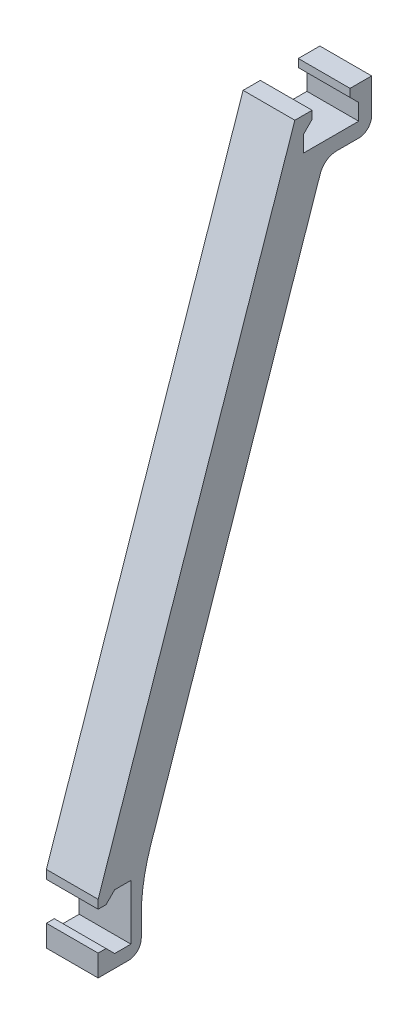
ISO-10303-21;
HEADER;
FILE_DESCRIPTION(('STEP AP214'),'2;1');
FILE_NAME('part.step','',(''),(''),'','','');
FILE_SCHEMA(('AUTOMOTIVE_DESIGN { 1 0 10303 214 1 1 1 1 }'));
ENDSEC;
DATA;
#1=APPLICATION_CONTEXT('core data for automotive mechanical design processes');
#2=APPLICATION_PROTOCOL_DEFINITION('international standard','automotive_design',2000,#1);
#3=PRODUCT_CONTEXT('',#1,'mechanical');
#4=PRODUCT('Part','Part','',(#3));
#5=PRODUCT_RELATED_PRODUCT_CATEGORY('part','',(#4));
#6=PRODUCT_DEFINITION_FORMATION('','',#4);
#7=PRODUCT_DEFINITION_CONTEXT('part definition',#1,'design');
#8=PRODUCT_DEFINITION('design','',#6,#7);
#9=PRODUCT_DEFINITION_SHAPE('','',#8);
#10=(LENGTH_UNIT() NAMED_UNIT(*) SI_UNIT(.MILLI.,.METRE.));
#11=(NAMED_UNIT(*) PLANE_ANGLE_UNIT() SI_UNIT($,.RADIAN.));
#12=(NAMED_UNIT(*) SI_UNIT($,.STERADIAN.) SOLID_ANGLE_UNIT());
#13=UNCERTAINTY_MEASURE_WITH_UNIT(LENGTH_MEASURE(1.E-05),#10,'distance_accuracy_value','');
#14=(GEOMETRIC_REPRESENTATION_CONTEXT(3) GLOBAL_UNCERTAINTY_ASSIGNED_CONTEXT((#13)) GLOBAL_UNIT_ASSIGNED_CONTEXT((#10,
#11,#12)) REPRESENTATION_CONTEXT('',''));
#15=CARTESIAN_POINT('',(0.,0.,0.));
#16=DIRECTION('',(0.,0.,1.));
#17=DIRECTION('',(1.,0.,0.));
#18=AXIS2_PLACEMENT_3D('',#15,#16,#17);
#19=CARTESIAN_POINT('',(6.,-82.2,-10.));
#20=DIRECTION('',(0.,0.,-1.));
#21=DIRECTION('',(-1.,0.,0.));
#22=AXIS2_PLACEMENT_3D('',#19,#20,#21);
#23=PLANE('',#22);
#24=DIRECTION('',(0.,-1.,0.));
#25=VECTOR('',#24,1.);
#26=CARTESIAN_POINT('',(0.,-82.2,-10.));
#27=LINE('',#26,#25);
#28=CARTESIAN_POINT('',(0.,-82.2,-10.));
#29=VERTEX_POINT('',#28);
#30=CARTESIAN_POINT('',(0.,-84.7,-10.));
#31=VERTEX_POINT('',#30);
#32=EDGE_CURVE('E248',#29,#31,#27,.T.);
#33=ORIENTED_EDGE('',*,*,#32,.T.);
#34=DIRECTION('',(-1.,0.,0.));
#35=VECTOR('',#34,1.);
#36=CARTESIAN_POINT('',(6.,-84.7,-10.));
#37=LINE('',#36,#35);
#38=CARTESIAN_POINT('',(6.,-84.7,-10.));
#39=VERTEX_POINT('',#38);
#40=EDGE_CURVE('E229',#39,#31,#37,.T.);
#41=ORIENTED_EDGE('',*,*,#40,.F.);
#42=DIRECTION('',(0.,-1.,0.));
#43=VECTOR('',#42,1.);
#44=CARTESIAN_POINT('',(6.,-82.2,-10.));
#45=LINE('',#44,#43);
#46=CARTESIAN_POINT('',(6.,-82.2,-10.));
#47=VERTEX_POINT('',#46);
#48=EDGE_CURVE('E236',#47,#39,#45,.T.);
#49=ORIENTED_EDGE('',*,*,#48,.F.);
#50=DIRECTION('',(-1.,0.,0.));
#51=VECTOR('',#50,1.);
#52=CARTESIAN_POINT('',(6.,-82.2,-10.));
#53=LINE('',#52,#51);
#54=EDGE_CURVE('E341',#47,#29,#53,.T.);
#55=ORIENTED_EDGE('',*,*,#54,.T.);
#56=EDGE_LOOP('',(#33,#41,#49,#55));
#57=FACE_BOUND('',#56,.T.);
#58=ADVANCED_FACE('F39',(#57),#23,.F.);
#59=CARTESIAN_POINT('',(6.,-84.7,-10.));
#60=DIRECTION('',(0.,1.,0.));
#61=DIRECTION('',(0.,0.,1.));
#62=AXIS2_PLACEMENT_3D('',#59,#60,#61);
#63=PLANE('',#62);
#64=DIRECTION('',(0.,0.,-1.));
#65=VECTOR('',#64,1.);
#66=CARTESIAN_POINT('',(0.,-84.7,-10.));
#67=LINE('',#66,#65);
#68=CARTESIAN_POINT('',(0.,-84.7,-13.5));
#69=VERTEX_POINT('',#68);
#70=EDGE_CURVE('E447',#31,#69,#67,.T.);
#71=ORIENTED_EDGE('',*,*,#70,.T.);
#72=DIRECTION('',(-1.,0.,0.));
#73=VECTOR('',#72,1.);
#74=CARTESIAN_POINT('',(6.,-84.7,-13.5));
#75=LINE('',#74,#73);
#76=CARTESIAN_POINT('',(6.,-84.7,-13.5));
#77=VERTEX_POINT('',#76);
#78=EDGE_CURVE('E232',#69,#77,#75,.F.);
#79=ORIENTED_EDGE('',*,*,#78,.T.);
#80=DIRECTION('',(0.,0.,-1.));
#81=VECTOR('',#80,1.);
#82=CARTESIAN_POINT('',(6.,-84.7,-10.));
#83=LINE('',#82,#81);
#84=EDGE_CURVE('E224',#39,#77,#83,.T.);
#85=ORIENTED_EDGE('',*,*,#84,.F.);
#86=ORIENTED_EDGE('',*,*,#40,.T.);
#87=EDGE_LOOP('',(#71,#79,#85,#86));
#88=FACE_BOUND('',#87,.T.);
#89=ADVANCED_FACE('F227',(#88),#63,.F.);
#90=CARTESIAN_POINT('',(6.,-84.7,-15.));
#91=DIRECTION('',(0.,0.,1.));
#92=DIRECTION('',(1.,0.,0.));
#93=AXIS2_PLACEMENT_3D('',#90,#91,#92);
#94=PLANE('',#93);
#95=DIRECTION('',(0.,1.,0.));
#96=VECTOR('',#95,1.);
#97=CARTESIAN_POINT('',(0.,-84.7,-15.));
#98=LINE('',#97,#96);
#99=CARTESIAN_POINT('',(0.,-83.2,-15.));
#100=VERTEX_POINT('',#99);
#101=CARTESIAN_POINT('',(0.,-80.9489592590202,-15.));
#102=VERTEX_POINT('',#101);
#103=EDGE_CURVE('E303',#100,#102,#98,.T.);
#104=ORIENTED_EDGE('',*,*,#103,.T.);
#105=DIRECTION('',(-1.,0.,0.));
#106=VECTOR('',#105,1.);
#107=CARTESIAN_POINT('',(6.,-80.9489592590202,-15.));
#108=LINE('',#107,#106);
#109=CARTESIAN_POINT('',(6.,-80.9489592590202,-15.));
#110=VERTEX_POINT('',#109);
#111=EDGE_CURVE('E278',#102,#110,#108,.F.);
#112=ORIENTED_EDGE('',*,*,#111,.T.);
#113=DIRECTION('',(0.,1.,0.));
#114=VECTOR('',#113,1.);
#115=CARTESIAN_POINT('',(6.,-84.7,-15.));
#116=LINE('',#115,#114);
#117=CARTESIAN_POINT('',(6.,-83.2,-15.));
#118=VERTEX_POINT('',#117);
#119=EDGE_CURVE('E235',#118,#110,#116,.T.);
#120=ORIENTED_EDGE('',*,*,#119,.F.);
#121=DIRECTION('',(-1.,0.,0.));
#122=VECTOR('',#121,1.);
#123=CARTESIAN_POINT('',(6.,-83.2,-15.));
#124=LINE('',#123,#122);
#125=EDGE_CURVE('E271',#118,#100,#124,.T.);
#126=ORIENTED_EDGE('',*,*,#125,.T.);
#127=EDGE_LOOP('',(#104,#112,#120,#126));
#128=FACE_BOUND('',#127,.T.);
#129=ADVANCED_FACE('F452',(#128),#94,.F.);
#130=CARTESIAN_POINT('',(6.,-77.629791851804,-15.));
#131=DIRECTION('',(0.,0.323020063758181,0.946392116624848));
#132=DIRECTION('',(0.,-0.946392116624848,0.323020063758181));
#133=AXIS2_PLACEMENT_3D('',#130,#131,#132);
#134=PLANE('',#133);
#135=DIRECTION('',(0.,0.946392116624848,-0.323020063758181));
#136=VECTOR('',#135,1.);
#137=CARTESIAN_POINT('',(0.,-77.629791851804,-15.));
#138=LINE('',#137,#136);
#139=CARTESIAN_POINT('',(0.,-74.4885579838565,-16.0721576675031));
#140=VERTEX_POINT('',#139);
#141=CARTESIAN_POINT('',(0.,-16.8539598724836,-35.7438468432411));
#142=VERTEX_POINT('',#141);
#143=EDGE_CURVE('E299',#140,#142,#138,.T.);
#144=ORIENTED_EDGE('',*,*,#143,.T.);
#145=DIRECTION('',(-1.,0.,0.));
#146=VECTOR('',#145,1.);
#147=CARTESIAN_POINT('',(6.,-16.8539598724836,-35.7438468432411));
#148=LINE('',#147,#146);
#149=CARTESIAN_POINT('',(6.,-16.8539598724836,-35.7438468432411));
#150=VERTEX_POINT('',#149);
#151=EDGE_CURVE('E60',#142,#150,#148,.F.);
#152=ORIENTED_EDGE('',*,*,#151,.T.);
#153=DIRECTION('',(0.,0.946392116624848,-0.323020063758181));
#154=VECTOR('',#153,1.);
#155=CARTESIAN_POINT('',(6.,-77.629791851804,-15.));
#156=LINE('',#155,#154);
#157=CARTESIAN_POINT('',(6.,-74.4885579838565,-16.0721576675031));
#158=VERTEX_POINT('',#157);
#159=EDGE_CURVE('E460',#158,#150,#156,.T.);
#160=ORIENTED_EDGE('',*,*,#159,.F.);
#161=DIRECTION('',(-1.,0.,0.));
#162=VECTOR('',#161,1.);
#163=CARTESIAN_POINT('',(0.,-74.4885579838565,-16.0721576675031));
#164=LINE('',#163,#162);
#165=EDGE_CURVE('E275',#158,#140,#164,.T.);
#166=ORIENTED_EDGE('',*,*,#165,.T.);
#167=EDGE_LOOP('',(#144,#152,#160,#166));
#168=FACE_BOUND('',#167,.T.);
#169=ADVANCED_FACE('F461',(#168),#134,.F.);
#170=CARTESIAN_POINT('',(6.,-15.5,-36.2059768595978));
#171=DIRECTION('',(0.,1.,0.));
#172=DIRECTION('',(0.,0.,1.));
#173=AXIS2_PLACEMENT_3D('',#170,#171,#172);
#174=PLANE('',#173);
#175=DIRECTION('',(0.,0.,-1.));
#176=VECTOR('',#175,1.);
#177=CARTESIAN_POINT('',(6.,-15.5,-36.2059768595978));
#178=LINE('',#177,#176);
#179=CARTESIAN_POINT('',(6.,-15.5,-37.6366310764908));
#180=VERTEX_POINT('',#179);
#181=CARTESIAN_POINT('',(6.,-15.5,-40.2));
#182=VERTEX_POINT('',#181);
#183=EDGE_CURVE('E292',#180,#182,#178,.T.);
#184=ORIENTED_EDGE('',*,*,#183,.F.);
#185=DIRECTION('',(-1.,0.,0.));
#186=VECTOR('',#185,1.);
#187=CARTESIAN_POINT('',(0.,-15.5,-37.6366310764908));
#188=LINE('',#187,#186);
#189=CARTESIAN_POINT('',(0.,-15.5,-37.6366310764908));
#190=VERTEX_POINT('',#189);
#191=EDGE_CURVE('E284',#180,#190,#188,.T.);
#192=ORIENTED_EDGE('',*,*,#191,.T.);
#193=DIRECTION('',(0.,0.,-1.));
#194=VECTOR('',#193,1.);
#195=CARTESIAN_POINT('',(0.,-15.5,-36.2059768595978));
#196=LINE('',#195,#194);
#197=CARTESIAN_POINT('',(0.,-15.5,-40.2));
#198=VERTEX_POINT('',#197);
#199=EDGE_CURVE('E291',#190,#198,#196,.T.);
#200=ORIENTED_EDGE('',*,*,#199,.T.);
#201=DIRECTION('',(-1.,0.,0.));
#202=VECTOR('',#201,1.);
#203=CARTESIAN_POINT('',(6.,-15.5,-40.2));
#204=LINE('',#203,#202);
#205=EDGE_CURVE('E264',#198,#182,#204,.F.);
#206=ORIENTED_EDGE('',*,*,#205,.T.);
#207=EDGE_LOOP('',(#184,#192,#200,#206));
#208=FACE_BOUND('',#207,.T.);
#209=ADVANCED_FACE('F290',(#208),#174,.F.);
#210=CARTESIAN_POINT('',(6.,-15.5,-41.7));
#211=DIRECTION('',(0.,0.,1.));
#212=DIRECTION('',(1.,0.,0.));
#213=AXIS2_PLACEMENT_3D('',#210,#211,#212);
#214=PLANE('',#213);
#215=DIRECTION('',(0.,1.,0.));
#216=VECTOR('',#215,1.);
#217=CARTESIAN_POINT('',(6.,-15.5,-41.7));
#218=LINE('',#217,#216);
#219=CARTESIAN_POINT('',(6.,-14.,-41.7));
#220=VERTEX_POINT('',#219);
#221=CARTESIAN_POINT('',(6.,-9.99999999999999,-41.7));
#222=VERTEX_POINT('',#221);
#223=EDGE_CURVE('E463',#220,#222,#218,.T.);
#224=ORIENTED_EDGE('',*,*,#223,.F.);
#225=DIRECTION('',(-1.,0.,0.));
#226=VECTOR('',#225,1.);
#227=CARTESIAN_POINT('',(6.,-14.,-41.7));
#228=LINE('',#227,#226);
#229=CARTESIAN_POINT('',(0.,-14.,-41.7));
#230=VERTEX_POINT('',#229);
#231=EDGE_CURVE('E249',#220,#230,#228,.T.);
#232=ORIENTED_EDGE('',*,*,#231,.T.);
#233=DIRECTION('',(0.,1.,0.));
#234=VECTOR('',#233,1.);
#235=CARTESIAN_POINT('',(0.,-15.5,-41.7));
#236=LINE('',#235,#234);
#237=CARTESIAN_POINT('',(0.,-9.99999999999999,-41.7));
#238=VERTEX_POINT('',#237);
#239=EDGE_CURVE('E298',#230,#238,#236,.T.);
#240=ORIENTED_EDGE('',*,*,#239,.T.);
#241=DIRECTION('',(-1.,0.,0.));
#242=VECTOR('',#241,1.);
#243=CARTESIAN_POINT('',(6.,-9.99999999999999,-41.7));
#244=LINE('',#243,#242);
#245=EDGE_CURVE('E250',#222,#238,#244,.T.);
#246=ORIENTED_EDGE('',*,*,#245,.F.);
#247=EDGE_LOOP('',(#224,#232,#240,#246));
#248=FACE_BOUND('',#247,.T.);
#249=ADVANCED_FACE('F473',(#248),#214,.F.);
#250=CARTESIAN_POINT('',(6.,-9.99999999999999,-41.7));
#251=DIRECTION('',(0.,-1.,0.));
#252=DIRECTION('',(0.,0.,-1.));
#253=AXIS2_PLACEMENT_3D('',#250,#251,#252);
#254=PLANE('',#253);
#255=DIRECTION('',(0.,0.,1.));
#256=VECTOR('',#255,1.);
#257=CARTESIAN_POINT('',(0.,-9.99999999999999,-41.7));
#258=LINE('',#257,#256);
#259=CARTESIAN_POINT('',(0.,-9.99999999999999,-39.2));
#260=VERTEX_POINT('',#259);
#261=EDGE_CURVE('E301',#238,#260,#258,.T.);
#262=ORIENTED_EDGE('',*,*,#261,.T.);
#263=DIRECTION('',(-1.,0.,0.));
#264=VECTOR('',#263,1.);
#265=CARTESIAN_POINT('',(6.,-9.99999999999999,-39.2));
#266=LINE('',#265,#264);
#267=CARTESIAN_POINT('',(6.,-9.99999999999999,-39.2));
#268=VERTEX_POINT('',#267);
#269=EDGE_CURVE('E256',#268,#260,#266,.T.);
#270=ORIENTED_EDGE('',*,*,#269,.F.);
#271=DIRECTION('',(0.,0.,1.));
#272=VECTOR('',#271,1.);
#273=CARTESIAN_POINT('',(6.,-9.99999999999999,-41.7));
#274=LINE('',#273,#272);
#275=EDGE_CURVE('E468',#222,#268,#274,.T.);
#276=ORIENTED_EDGE('',*,*,#275,.F.);
#277=ORIENTED_EDGE('',*,*,#245,.T.);
#278=EDGE_LOOP('',(#262,#270,#276,#277));
#279=FACE_BOUND('',#278,.T.);
#280=ADVANCED_FACE('F471',(#279),#254,.F.);
#281=CARTESIAN_POINT('',(6.,-9.99999999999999,-39.2));
#282=DIRECTION('',(0.,0.,-1.));
#283=DIRECTION('',(0.,1.,0.));
#284=AXIS2_PLACEMENT_3D('',#281,#282,#283);
#285=PLANE('',#284);
#286=DIRECTION('',(0.,-1.,0.));
#287=VECTOR('',#286,1.);
#288=CARTESIAN_POINT('',(0.,-9.99999999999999,-39.2));
#289=LINE('',#288,#287);
#290=CARTESIAN_POINT('',(0.,-10.9171572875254,-39.2));
#291=VERTEX_POINT('',#290);
#292=EDGE_CURVE('E308',#260,#291,#289,.T.);
#293=ORIENTED_EDGE('',*,*,#292,.T.);
#294=DIRECTION('',(-1.,0.,0.));
#295=VECTOR('',#294,1.);
#296=CARTESIAN_POINT('',(6.,-10.9171572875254,-39.2));
#297=LINE('',#296,#295);
#298=CARTESIAN_POINT('',(6.,-10.9171572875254,-39.2));
#299=VERTEX_POINT('',#298);
#300=EDGE_CURVE('E388',#299,#291,#297,.T.);
#301=ORIENTED_EDGE('',*,*,#300,.F.);
#302=DIRECTION('',(0.,-1.,0.));
#303=VECTOR('',#302,1.);
#304=CARTESIAN_POINT('',(6.,-9.99999999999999,-39.2));
#305=LINE('',#304,#303);
#306=EDGE_CURVE('E397',#268,#299,#305,.T.);
#307=ORIENTED_EDGE('',*,*,#306,.F.);
#308=ORIENTED_EDGE('',*,*,#269,.T.);
#309=EDGE_LOOP('',(#293,#301,#307,#308));
#310=FACE_BOUND('',#309,.T.);
#311=ADVANCED_FACE('F395',(#310),#285,.F.);
#312=CARTESIAN_POINT('',(6.,-10.9171572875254,-39.2));
#313=DIRECTION('',(0.,0.707106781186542,-0.707106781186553));
#314=DIRECTION('',(0.,0.707106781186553,0.707106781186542));
#315=AXIS2_PLACEMENT_3D('',#312,#313,#314);
#316=PLANE('',#315);
#317=DIRECTION('',(0.,-0.707106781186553,-0.707106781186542));
#318=VECTOR('',#317,1.);
#319=CARTESIAN_POINT('',(0.,-10.9171572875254,-39.2));
#320=LINE('',#319,#318);
#321=CARTESIAN_POINT('',(0.,-11.9171572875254,-40.2));
#322=VERTEX_POINT('',#321);
#323=EDGE_CURVE('E310',#291,#322,#320,.T.);
#324=ORIENTED_EDGE('',*,*,#323,.T.);
#325=DIRECTION('',(-1.,0.,0.));
#326=VECTOR('',#325,1.);
#327=CARTESIAN_POINT('',(6.,-11.9171572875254,-40.2));
#328=LINE('',#327,#326);
#329=CARTESIAN_POINT('',(6.,-11.9171572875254,-40.2));
#330=VERTEX_POINT('',#329);
#331=EDGE_CURVE('E385',#330,#322,#328,.T.);
#332=ORIENTED_EDGE('',*,*,#331,.F.);
#333=DIRECTION('',(0.,-0.707106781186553,-0.707106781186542));
#334=VECTOR('',#333,1.);
#335=CARTESIAN_POINT('',(6.,-10.9171572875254,-39.2));
#336=LINE('',#335,#334);
#337=EDGE_CURVE('E415',#299,#330,#336,.T.);
#338=ORIENTED_EDGE('',*,*,#337,.F.);
#339=ORIENTED_EDGE('',*,*,#300,.T.);
#340=EDGE_LOOP('',(#324,#332,#338,#339));
#341=FACE_BOUND('',#340,.T.);
#342=ADVANCED_FACE('F406',(#341),#316,.F.);
#343=CARTESIAN_POINT('',(6.,-11.9171572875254,-40.2));
#344=DIRECTION('',(0.,0.,-1.));
#345=DIRECTION('',(-1.,0.,0.));
#346=AXIS2_PLACEMENT_3D('',#343,#344,#345);
#347=PLANE('',#346);
#348=DIRECTION('',(0.,-1.,0.));
#349=VECTOR('',#348,1.);
#350=CARTESIAN_POINT('',(0.,-11.9171572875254,-40.2));
#351=LINE('',#350,#349);
#352=CARTESIAN_POINT('',(0.,-13.8,-40.2));
#353=VERTEX_POINT('',#352);
#354=EDGE_CURVE('E312',#322,#353,#351,.T.);
#355=ORIENTED_EDGE('',*,*,#354,.T.);
#356=DIRECTION('',(-1.,0.,0.));
#357=VECTOR('',#356,1.);
#358=CARTESIAN_POINT('',(6.,-13.8,-40.2));
#359=LINE('',#358,#357);
#360=CARTESIAN_POINT('',(6.,-13.8,-40.2));
#361=VERTEX_POINT('',#360);
#362=EDGE_CURVE('E382',#361,#353,#359,.T.);
#363=ORIENTED_EDGE('',*,*,#362,.F.);
#364=DIRECTION('',(0.,-1.,0.));
#365=VECTOR('',#364,1.);
#366=CARTESIAN_POINT('',(6.,-11.9171572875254,-40.2));
#367=LINE('',#366,#365);
#368=EDGE_CURVE('E412',#330,#361,#367,.T.);
#369=ORIENTED_EDGE('',*,*,#368,.F.);
#370=ORIENTED_EDGE('',*,*,#331,.T.);
#371=EDGE_LOOP('',(#355,#363,#369,#370));
#372=FACE_BOUND('',#371,.T.);
#373=ADVANCED_FACE('F410',(#372),#347,.F.);
#374=CARTESIAN_POINT('',(6.,-13.8,-40.2));
#375=DIRECTION('',(0.,-1.,0.));
#376=DIRECTION('',(0.,0.,-1.));
#377=AXIS2_PLACEMENT_3D('',#374,#375,#376);
#378=PLANE('',#377);
#379=DIRECTION('',(0.,0.,1.));
#380=VECTOR('',#379,1.);
#381=CARTESIAN_POINT('',(0.,-13.8,-40.2));
#382=LINE('',#381,#380);
#383=CARTESIAN_POINT('',(0.,-13.8,-33.8));
#384=VERTEX_POINT('',#383);
#385=EDGE_CURVE('E314',#353,#384,#382,.T.);
#386=ORIENTED_EDGE('',*,*,#385,.T.);
#387=DIRECTION('',(-1.,0.,0.));
#388=VECTOR('',#387,1.);
#389=CARTESIAN_POINT('',(6.,-13.8,-33.8));
#390=LINE('',#389,#388);
#391=CARTESIAN_POINT('',(6.,-13.8,-33.8));
#392=VERTEX_POINT('',#391);
#393=EDGE_CURVE('E379',#392,#384,#390,.T.);
#394=ORIENTED_EDGE('',*,*,#393,.F.);
#395=DIRECTION('',(0.,0.,1.));
#396=VECTOR('',#395,1.);
#397=CARTESIAN_POINT('',(6.,-13.8,-40.2));
#398=LINE('',#397,#396);
#399=EDGE_CURVE('E414',#361,#392,#398,.T.);
#400=ORIENTED_EDGE('',*,*,#399,.F.);
#401=ORIENTED_EDGE('',*,*,#362,.T.);
#402=EDGE_LOOP('',(#386,#394,#400,#401));
#403=FACE_BOUND('',#402,.T.);
#404=ADVANCED_FACE('F565',(#403),#378,.F.);
#405=CARTESIAN_POINT('',(6.,-13.8,-33.8));
#406=DIRECTION('',(0.,0.,1.));
#407=DIRECTION('',(1.,0.,0.));
#408=AXIS2_PLACEMENT_3D('',#405,#406,#407);
#409=PLANE('',#408);
#410=DIRECTION('',(0.,1.,0.));
#411=VECTOR('',#410,1.);
#412=CARTESIAN_POINT('',(0.,-13.8,-33.8));
#413=LINE('',#412,#411);
#414=CARTESIAN_POINT('',(0.,-11.9171572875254,-33.8));
#415=VERTEX_POINT('',#414);
#416=EDGE_CURVE('E316',#384,#415,#413,.T.);
#417=ORIENTED_EDGE('',*,*,#416,.T.);
#418=DIRECTION('',(-1.,0.,0.));
#419=VECTOR('',#418,1.);
#420=CARTESIAN_POINT('',(6.,-11.9171572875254,-33.8));
#421=LINE('',#420,#419);
#422=CARTESIAN_POINT('',(6.,-11.9171572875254,-33.8));
#423=VERTEX_POINT('',#422);
#424=EDGE_CURVE('E376',#423,#415,#421,.T.);
#425=ORIENTED_EDGE('',*,*,#424,.F.);
#426=DIRECTION('',(0.,1.,0.));
#427=VECTOR('',#426,1.);
#428=CARTESIAN_POINT('',(6.,-13.8,-33.8));
#429=LINE('',#428,#427);
#430=EDGE_CURVE('E417',#392,#423,#429,.T.);
#431=ORIENTED_EDGE('',*,*,#430,.F.);
#432=ORIENTED_EDGE('',*,*,#393,.T.);
#433=EDGE_LOOP('',(#417,#425,#431,#432));
#434=FACE_BOUND('',#433,.T.);
#435=ADVANCED_FACE('F561',(#434),#409,.F.);
#436=CARTESIAN_POINT('',(6.,-11.9171572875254,-33.8));
#437=DIRECTION('',(0.,0.707106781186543,0.707106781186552));
#438=DIRECTION('',(0.,-0.707106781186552,0.707106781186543));
#439=AXIS2_PLACEMENT_3D('',#436,#437,#438);
#440=PLANE('',#439);
#441=DIRECTION('',(0.,0.707106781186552,-0.707106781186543));
#442=VECTOR('',#441,1.);
#443=CARTESIAN_POINT('',(0.,-11.9171572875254,-33.8));
#444=LINE('',#443,#442);
#445=CARTESIAN_POINT('',(0.,-10.9171572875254,-34.8));
#446=VERTEX_POINT('',#445);
#447=EDGE_CURVE('E318',#415,#446,#444,.T.);
#448=ORIENTED_EDGE('',*,*,#447,.T.);
#449=DIRECTION('',(-1.,0.,0.));
#450=VECTOR('',#449,1.);
#451=CARTESIAN_POINT('',(6.,-10.9171572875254,-34.8));
#452=LINE('',#451,#450);
#453=CARTESIAN_POINT('',(6.,-10.9171572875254,-34.8));
#454=VERTEX_POINT('',#453);
#455=EDGE_CURVE('E373',#454,#446,#452,.T.);
#456=ORIENTED_EDGE('',*,*,#455,.F.);
#457=DIRECTION('',(0.,0.707106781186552,-0.707106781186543));
#458=VECTOR('',#457,1.);
#459=CARTESIAN_POINT('',(6.,-11.9171572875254,-33.8));
#460=LINE('',#459,#458);
#461=EDGE_CURVE('E423',#423,#454,#460,.T.);
#462=ORIENTED_EDGE('',*,*,#461,.F.);
#463=ORIENTED_EDGE('',*,*,#424,.T.);
#464=EDGE_LOOP('',(#448,#456,#462,#463));
#465=FACE_BOUND('',#464,.T.);
#466=ADVANCED_FACE('F557',(#465),#440,.F.);
#467=CARTESIAN_POINT('',(6.,-10.9171572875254,-34.8));
#468=DIRECTION('',(0.,0.,1.));
#469=DIRECTION('',(0.,-1.,0.));
#470=AXIS2_PLACEMENT_3D('',#467,#468,#469);
#471=PLANE('',#470);
#472=DIRECTION('',(0.,1.,0.));
#473=VECTOR('',#472,1.);
#474=CARTESIAN_POINT('',(0.,-10.9171572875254,-34.8));
#475=LINE('',#474,#473);
#476=CARTESIAN_POINT('',(0.,-9.99999999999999,-34.8));
#477=VERTEX_POINT('',#476);
#478=EDGE_CURVE('E320',#446,#477,#475,.T.);
#479=ORIENTED_EDGE('',*,*,#478,.T.);
#480=DIRECTION('',(-1.,0.,0.));
#481=VECTOR('',#480,1.);
#482=CARTESIAN_POINT('',(6.,-9.99999999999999,-34.8));
#483=LINE('',#482,#481);
#484=CARTESIAN_POINT('',(6.,-9.99999999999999,-34.8));
#485=VERTEX_POINT('',#484);
#486=EDGE_CURVE('E370',#485,#477,#483,.T.);
#487=ORIENTED_EDGE('',*,*,#486,.F.);
#488=DIRECTION('',(0.,1.,0.));
#489=VECTOR('',#488,1.);
#490=CARTESIAN_POINT('',(6.,-10.9171572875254,-34.8));
#491=LINE('',#490,#489);
#492=EDGE_CURVE('E425',#454,#485,#491,.T.);
#493=ORIENTED_EDGE('',*,*,#492,.F.);
#494=ORIENTED_EDGE('',*,*,#455,.T.);
#495=EDGE_LOOP('',(#479,#487,#493,#494));
#496=FACE_BOUND('',#495,.T.);
#497=ADVANCED_FACE('F553',(#496),#471,.F.);
#498=CARTESIAN_POINT('',(6.,-9.99999999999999,-34.8));
#499=DIRECTION('',(0.,-1.,0.));
#500=DIRECTION('',(0.,0.,-1.));
#501=AXIS2_PLACEMENT_3D('',#498,#499,#500);
#502=PLANE('',#501);
#503=DIRECTION('',(0.,0.,1.));
#504=VECTOR('',#503,1.);
#505=CARTESIAN_POINT('',(0.,-9.99999999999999,-34.8));
#506=LINE('',#505,#504);
#507=CARTESIAN_POINT('',(0.,-9.99999999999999,-32.8));
#508=VERTEX_POINT('',#507);
#509=EDGE_CURVE('E322',#477,#508,#506,.T.);
#510=ORIENTED_EDGE('',*,*,#509,.T.);
#511=DIRECTION('',(-1.,0.,0.));
#512=VECTOR('',#511,1.);
#513=CARTESIAN_POINT('',(6.,-9.99999999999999,-32.8));
#514=LINE('',#513,#512);
#515=CARTESIAN_POINT('',(6.,-9.99999999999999,-32.8));
#516=VERTEX_POINT('',#515);
#517=EDGE_CURVE('E367',#516,#508,#514,.T.);
#518=ORIENTED_EDGE('',*,*,#517,.F.);
#519=DIRECTION('',(0.,0.,1.));
#520=VECTOR('',#519,1.);
#521=CARTESIAN_POINT('',(6.,-9.99999999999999,-34.8));
#522=LINE('',#521,#520);
#523=EDGE_CURVE('E427',#485,#516,#522,.T.);
#524=ORIENTED_EDGE('',*,*,#523,.F.);
#525=ORIENTED_EDGE('',*,*,#486,.T.);
#526=EDGE_LOOP('',(#510,#518,#524,#525));
#527=FACE_BOUND('',#526,.T.);
#528=ADVANCED_FACE('F548',(#527),#502,.F.);
#529=CARTESIAN_POINT('',(6.,-9.99999999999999,-32.8));
#530=DIRECTION('',(0.,-0.323020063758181,-0.946392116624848));
#531=DIRECTION('',(0.,0.946392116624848,-0.323020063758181));
#532=AXIS2_PLACEMENT_3D('',#529,#530,#531);
#533=PLANE('',#532);
#534=DIRECTION('',(0.,-0.946392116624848,0.323020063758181));
#535=VECTOR('',#534,1.);
#536=CARTESIAN_POINT('',(0.,-9.99999999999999,-32.8));
#537=LINE('',#536,#535);
#538=CARTESIAN_POINT('',(0.,-76.8,-10.));
#539=VERTEX_POINT('',#538);
#540=EDGE_CURVE('E324',#508,#539,#537,.T.);
#541=ORIENTED_EDGE('',*,*,#540,.T.);
#542=DIRECTION('',(-1.,0.,0.));
#543=VECTOR('',#542,1.);
#544=CARTESIAN_POINT('',(6.,-76.8,-10.));
#545=LINE('',#544,#543);
#546=CARTESIAN_POINT('',(6.,-76.8,-10.));
#547=VERTEX_POINT('',#546);
#548=EDGE_CURVE('E364',#547,#539,#545,.T.);
#549=ORIENTED_EDGE('',*,*,#548,.F.);
#550=DIRECTION('',(0.,-0.946392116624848,0.323020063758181));
#551=VECTOR('',#550,1.);
#552=CARTESIAN_POINT('',(6.,-9.99999999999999,-32.8));
#553=LINE('',#552,#551);
#554=EDGE_CURVE('E429',#516,#547,#553,.T.);
#555=ORIENTED_EDGE('',*,*,#554,.F.);
#556=ORIENTED_EDGE('',*,*,#517,.T.);
#557=EDGE_LOOP('',(#541,#549,#555,#556));
#558=FACE_BOUND('',#557,.T.);
#559=ADVANCED_FACE('F542',(#558),#533,.F.);
#560=CARTESIAN_POINT('',(6.,-76.8,-10.));
#561=DIRECTION('',(0.,0.,-1.));
#562=DIRECTION('',(-1.,0.,0.));
#563=AXIS2_PLACEMENT_3D('',#560,#561,#562);
#564=PLANE('',#563);
#565=DIRECTION('',(0.,-1.,0.));
#566=VECTOR('',#565,1.);
#567=CARTESIAN_POINT('',(0.,-76.8,-10.));
#568=LINE('',#567,#566);
#569=CARTESIAN_POINT('',(0.,-77.8,-10.));
#570=VERTEX_POINT('',#569);
#571=EDGE_CURVE('E326',#539,#570,#568,.T.);
#572=ORIENTED_EDGE('',*,*,#571,.T.);
#573=DIRECTION('',(-1.,0.,0.));
#574=VECTOR('',#573,1.);
#575=CARTESIAN_POINT('',(6.,-77.8,-10.));
#576=LINE('',#575,#574);
#577=CARTESIAN_POINT('',(6.,-77.8,-10.));
#578=VERTEX_POINT('',#577);
#579=EDGE_CURVE('E361',#578,#570,#576,.T.);
#580=ORIENTED_EDGE('',*,*,#579,.F.);
#581=DIRECTION('',(0.,-1.,0.));
#582=VECTOR('',#581,1.);
#583=CARTESIAN_POINT('',(6.,-76.8,-10.));
#584=LINE('',#583,#582);
#585=EDGE_CURVE('E431',#547,#578,#584,.T.);
#586=ORIENTED_EDGE('',*,*,#585,.F.);
#587=ORIENTED_EDGE('',*,*,#548,.T.);
#588=EDGE_LOOP('',(#572,#580,#586,#587));
#589=FACE_BOUND('',#588,.T.);
#590=ADVANCED_FACE('F538',(#589),#564,.F.);
#591=CARTESIAN_POINT('',(6.,-77.8,-10.));
#592=DIRECTION('',(0.,1.,0.));
#593=DIRECTION('',(0.,0.,1.));
#594=AXIS2_PLACEMENT_3D('',#591,#592,#593);
#595=PLANE('',#594);
#596=DIRECTION('',(0.,0.,-1.));
#597=VECTOR('',#596,1.);
#598=CARTESIAN_POINT('',(0.,-77.8,-10.));
#599=LINE('',#598,#597);
#600=CARTESIAN_POINT('',(0.,-77.8,-10.9171572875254));
#601=VERTEX_POINT('',#600);
#602=EDGE_CURVE('E328',#570,#601,#599,.T.);
#603=ORIENTED_EDGE('',*,*,#602,.T.);
#604=DIRECTION('',(-1.,0.,0.));
#605=VECTOR('',#604,1.);
#606=CARTESIAN_POINT('',(6.,-77.8,-10.9171572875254));
#607=LINE('',#606,#605);
#608=CARTESIAN_POINT('',(6.,-77.8,-10.9171572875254));
#609=VERTEX_POINT('',#608);
#610=EDGE_CURVE('E358',#609,#601,#607,.T.);
#611=ORIENTED_EDGE('',*,*,#610,.F.);
#612=DIRECTION('',(0.,0.,-1.));
#613=VECTOR('',#612,1.);
#614=CARTESIAN_POINT('',(6.,-77.8,-10.));
#615=LINE('',#614,#613);
#616=EDGE_CURVE('E433',#578,#609,#615,.T.);
#617=ORIENTED_EDGE('',*,*,#616,.F.);
#618=ORIENTED_EDGE('',*,*,#579,.T.);
#619=EDGE_LOOP('',(#603,#611,#617,#618));
#620=FACE_BOUND('',#619,.T.);
#621=ADVANCED_FACE('F533',(#620),#595,.F.);
#622=CARTESIAN_POINT('',(6.,-77.8,-10.9171572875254));
#623=DIRECTION('',(0.,0.707106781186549,0.707106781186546));
#624=DIRECTION('',(0.,-0.707106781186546,0.707106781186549));
#625=AXIS2_PLACEMENT_3D('',#622,#623,#624);
#626=PLANE('',#625);
#627=DIRECTION('',(0.,0.707106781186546,-0.707106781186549));
#628=VECTOR('',#627,1.);
#629=CARTESIAN_POINT('',(0.,-77.8,-10.9171572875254));
#630=LINE('',#629,#628);
#631=CARTESIAN_POINT('',(0.,-76.8,-11.9171572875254));
#632=VERTEX_POINT('',#631);
#633=EDGE_CURVE('E330',#601,#632,#630,.T.);
#634=ORIENTED_EDGE('',*,*,#633,.T.);
#635=DIRECTION('',(-1.,0.,0.));
#636=VECTOR('',#635,1.);
#637=CARTESIAN_POINT('',(6.,-76.8,-11.9171572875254));
#638=LINE('',#637,#636);
#639=CARTESIAN_POINT('',(6.,-76.8,-11.9171572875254));
#640=VERTEX_POINT('',#639);
#641=EDGE_CURVE('E355',#640,#632,#638,.T.);
#642=ORIENTED_EDGE('',*,*,#641,.F.);
#643=DIRECTION('',(0.,0.707106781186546,-0.707106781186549));
#644=VECTOR('',#643,1.);
#645=CARTESIAN_POINT('',(6.,-77.8,-10.9171572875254));
#646=LINE('',#645,#644);
#647=EDGE_CURVE('E435',#609,#640,#646,.T.);
#648=ORIENTED_EDGE('',*,*,#647,.F.);
#649=ORIENTED_EDGE('',*,*,#610,.T.);
#650=EDGE_LOOP('',(#634,#642,#648,#649));
#651=FACE_BOUND('',#650,.T.);
#652=ADVANCED_FACE('F527',(#651),#626,.F.);
#653=CARTESIAN_POINT('',(6.,-76.8,-11.9171572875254));
#654=DIRECTION('',(0.,1.,0.));
#655=DIRECTION('',(0.,0.,1.));
#656=AXIS2_PLACEMENT_3D('',#653,#654,#655);
#657=PLANE('',#656);
#658=DIRECTION('',(0.,0.,-1.));
#659=VECTOR('',#658,1.);
#660=CARTESIAN_POINT('',(0.,-76.8,-11.9171572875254));
#661=LINE('',#660,#659);
#662=CARTESIAN_POINT('',(0.,-76.8,-13.8));
#663=VERTEX_POINT('',#662);
#664=EDGE_CURVE('E332',#632,#663,#661,.T.);
#665=ORIENTED_EDGE('',*,*,#664,.T.);
#666=DIRECTION('',(-1.,0.,0.));
#667=VECTOR('',#666,1.);
#668=CARTESIAN_POINT('',(6.,-76.8,-13.8));
#669=LINE('',#668,#667);
#670=CARTESIAN_POINT('',(6.,-76.8,-13.8));
#671=VERTEX_POINT('',#670);
#672=EDGE_CURVE('E352',#671,#663,#669,.T.);
#673=ORIENTED_EDGE('',*,*,#672,.F.);
#674=DIRECTION('',(0.,0.,-1.));
#675=VECTOR('',#674,1.);
#676=CARTESIAN_POINT('',(6.,-76.8,-11.9171572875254));
#677=LINE('',#676,#675);
#678=EDGE_CURVE('E437',#640,#671,#677,.T.);
#679=ORIENTED_EDGE('',*,*,#678,.F.);
#680=ORIENTED_EDGE('',*,*,#641,.T.);
#681=EDGE_LOOP('',(#665,#673,#679,#680));
#682=FACE_BOUND('',#681,.T.);
#683=ADVANCED_FACE('F523',(#682),#657,.F.);
#684=CARTESIAN_POINT('',(6.,-76.8,-13.8));
#685=DIRECTION('',(0.,0.,-1.));
#686=DIRECTION('',(0.,1.,0.));
#687=AXIS2_PLACEMENT_3D('',#684,#685,#686);
#688=PLANE('',#687);
#689=DIRECTION('',(0.,-1.,0.));
#690=VECTOR('',#689,1.);
#691=CARTESIAN_POINT('',(0.,-76.8,-13.8));
#692=LINE('',#691,#690);
#693=CARTESIAN_POINT('',(0.,-83.2,-13.8));
#694=VERTEX_POINT('',#693);
#695=EDGE_CURVE('E334',#663,#694,#692,.T.);
#696=ORIENTED_EDGE('',*,*,#695,.T.);
#697=DIRECTION('',(-1.,0.,0.));
#698=VECTOR('',#697,1.);
#699=CARTESIAN_POINT('',(6.,-83.2,-13.8));
#700=LINE('',#699,#698);
#701=CARTESIAN_POINT('',(6.,-83.2,-13.8));
#702=VERTEX_POINT('',#701);
#703=EDGE_CURVE('E349',#702,#694,#700,.T.);
#704=ORIENTED_EDGE('',*,*,#703,.F.);
#705=DIRECTION('',(0.,-1.,0.));
#706=VECTOR('',#705,1.);
#707=CARTESIAN_POINT('',(6.,-76.8,-13.8));
#708=LINE('',#707,#706);
#709=EDGE_CURVE('E439',#671,#702,#708,.T.);
#710=ORIENTED_EDGE('',*,*,#709,.F.);
#711=ORIENTED_EDGE('',*,*,#672,.T.);
#712=EDGE_LOOP('',(#696,#704,#710,#711));
#713=FACE_BOUND('',#712,.T.);
#714=ADVANCED_FACE('F518',(#713),#688,.F.);
#715=CARTESIAN_POINT('',(6.,-83.2,-13.8));
#716=DIRECTION('',(0.,-1.,0.));
#717=DIRECTION('',(0.,0.,-1.));
#718=AXIS2_PLACEMENT_3D('',#715,#716,#717);
#719=PLANE('',#718);
#720=DIRECTION('',(0.,0.,1.));
#721=VECTOR('',#720,1.);
#722=CARTESIAN_POINT('',(0.,-83.2,-13.8));
#723=LINE('',#722,#721);
#724=CARTESIAN_POINT('',(0.,-83.2,-11.9171572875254));
#725=VERTEX_POINT('',#724);
#726=EDGE_CURVE('E336',#694,#725,#723,.T.);
#727=ORIENTED_EDGE('',*,*,#726,.T.);
#728=DIRECTION('',(-1.,0.,0.));
#729=VECTOR('',#728,1.);
#730=CARTESIAN_POINT('',(6.,-83.2,-11.9171572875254));
#731=LINE('',#730,#729);
#732=CARTESIAN_POINT('',(6.,-83.2,-11.9171572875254));
#733=VERTEX_POINT('',#732);
#734=EDGE_CURVE('E346',#733,#725,#731,.T.);
#735=ORIENTED_EDGE('',*,*,#734,.F.);
#736=DIRECTION('',(0.,0.,1.));
#737=VECTOR('',#736,1.);
#738=CARTESIAN_POINT('',(6.,-83.2,-13.8));
#739=LINE('',#738,#737);
#740=EDGE_CURVE('E441',#702,#733,#739,.T.);
#741=ORIENTED_EDGE('',*,*,#740,.F.);
#742=ORIENTED_EDGE('',*,*,#703,.T.);
#743=EDGE_LOOP('',(#727,#735,#741,#742));
#744=FACE_BOUND('',#743,.T.);
#745=ADVANCED_FACE('F512',(#744),#719,.F.);
#746=CARTESIAN_POINT('',(6.,-83.2,-11.9171572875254));
#747=DIRECTION('',(0.,-0.707106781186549,0.707106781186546));
#748=DIRECTION('',(0.,-0.707106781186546,-0.707106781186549));
#749=AXIS2_PLACEMENT_3D('',#746,#747,#748);
#750=PLANE('',#749);
#751=DIRECTION('',(0.,0.707106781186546,0.707106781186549));
#752=VECTOR('',#751,1.);
#753=CARTESIAN_POINT('',(0.,-83.2,-11.9171572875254));
#754=LINE('',#753,#752);
#755=CARTESIAN_POINT('',(0.,-82.2,-10.9171572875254));
#756=VERTEX_POINT('',#755);
#757=EDGE_CURVE('E338',#725,#756,#754,.T.);
#758=ORIENTED_EDGE('',*,*,#757,.T.);
#759=DIRECTION('',(-1.,0.,0.));
#760=VECTOR('',#759,1.);
#761=CARTESIAN_POINT('',(6.,-82.2,-10.9171572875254));
#762=LINE('',#761,#760);
#763=CARTESIAN_POINT('',(6.,-82.2,-10.9171572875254));
#764=VERTEX_POINT('',#763);
#765=EDGE_CURVE('E343',#764,#756,#762,.T.);
#766=ORIENTED_EDGE('',*,*,#765,.F.);
#767=DIRECTION('',(0.,0.707106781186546,0.707106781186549));
#768=VECTOR('',#767,1.);
#769=CARTESIAN_POINT('',(6.,-83.2,-11.9171572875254));
#770=LINE('',#769,#768);
#771=EDGE_CURVE('E443',#733,#764,#770,.T.);
#772=ORIENTED_EDGE('',*,*,#771,.F.);
#773=ORIENTED_EDGE('',*,*,#734,.T.);
#774=EDGE_LOOP('',(#758,#766,#772,#773));
#775=FACE_BOUND('',#774,.T.);
#776=ADVANCED_FACE('F508',(#775),#750,.F.);
#777=CARTESIAN_POINT('',(6.,-82.2,-10.9171572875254));
#778=DIRECTION('',(0.,-1.,0.));
#779=DIRECTION('',(0.,0.,-1.));
#780=AXIS2_PLACEMENT_3D('',#777,#778,#779);
#781=PLANE('',#780);
#782=DIRECTION('',(0.,0.,1.));
#783=VECTOR('',#782,1.);
#784=CARTESIAN_POINT('',(0.,-82.2,-10.9171572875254));
#785=LINE('',#784,#783);
#786=EDGE_CURVE('E245',#756,#29,#785,.T.);
#787=ORIENTED_EDGE('',*,*,#786,.T.);
#788=ORIENTED_EDGE('',*,*,#54,.F.);
#789=DIRECTION('',(0.,0.,1.));
#790=VECTOR('',#789,1.);
#791=CARTESIAN_POINT('',(6.,-82.2,-10.9171572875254));
#792=LINE('',#791,#790);
#793=EDGE_CURVE('E241',#764,#47,#792,.T.);
#794=ORIENTED_EDGE('',*,*,#793,.F.);
#795=ORIENTED_EDGE('',*,*,#765,.T.);
#796=EDGE_LOOP('',(#787,#788,#794,#795));
#797=FACE_BOUND('',#796,.T.);
#798=ADVANCED_FACE('F504',(#797),#781,.F.);
#799=CARTESIAN_POINT('',(6.,0.,0.));
#800=DIRECTION('',(1.,0.,0.));
#801=DIRECTION('',(0.,0.,-1.));
#802=AXIS2_PLACEMENT_3D('',#799,#800,#801);
#803=PLANE('',#802);
#804=ORIENTED_EDGE('',*,*,#159,.T.);
#805=CARTESIAN_POINT('',(6.,-17.5,-37.6366310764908));
#806=DIRECTION('',(1.,0.,0.));
#807=DIRECTION('',(0.,0.,-1.));
#808=AXIS2_PLACEMENT_3D('',#805,#806,#807);
#809=CIRCLE('',#808,2.);
#810=EDGE_CURVE('E11',#150,#180,#809,.F.);
#811=ORIENTED_EDGE('',*,*,#810,.T.);
#812=ORIENTED_EDGE('',*,*,#183,.T.);
#813=CARTESIAN_POINT('',(6.,-14.,-40.2));
#814=DIRECTION('',(1.,0.,0.));
#815=DIRECTION('',(0.,0.,-1.));
#816=AXIS2_PLACEMENT_3D('',#813,#814,#815);
#817=CIRCLE('',#816,1.5);
#818=EDGE_CURVE('E269',#182,#220,#817,.T.);
#819=ORIENTED_EDGE('',*,*,#818,.T.);
#820=ORIENTED_EDGE('',*,*,#223,.T.);
#821=ORIENTED_EDGE('',*,*,#275,.T.);
#822=ORIENTED_EDGE('',*,*,#306,.T.);
#823=ORIENTED_EDGE('',*,*,#337,.T.);
#824=ORIENTED_EDGE('',*,*,#368,.T.);
#825=ORIENTED_EDGE('',*,*,#399,.T.);
#826=ORIENTED_EDGE('',*,*,#430,.T.);
#827=ORIENTED_EDGE('',*,*,#461,.T.);
#828=ORIENTED_EDGE('',*,*,#492,.T.);
#829=ORIENTED_EDGE('',*,*,#523,.T.);
#830=ORIENTED_EDGE('',*,*,#554,.T.);
#831=ORIENTED_EDGE('',*,*,#585,.T.);
#832=ORIENTED_EDGE('',*,*,#616,.T.);
#833=ORIENTED_EDGE('',*,*,#647,.T.);
#834=ORIENTED_EDGE('',*,*,#678,.T.);
#835=ORIENTED_EDGE('',*,*,#709,.T.);
#836=ORIENTED_EDGE('',*,*,#740,.T.);
#837=ORIENTED_EDGE('',*,*,#771,.T.);
#838=ORIENTED_EDGE('',*,*,#793,.T.);
#839=ORIENTED_EDGE('',*,*,#48,.T.);
#840=ORIENTED_EDGE('',*,*,#84,.T.);
#841=CARTESIAN_POINT('',(6.,-83.2,-13.5));
#842=DIRECTION('',(1.,0.,0.));
#843=DIRECTION('',(0.,0.,-1.));
#844=AXIS2_PLACEMENT_3D('',#841,#842,#843);
#845=CIRCLE('',#844,1.5);
#846=EDGE_CURVE('E267',#77,#118,#845,.T.);
#847=ORIENTED_EDGE('',*,*,#846,.T.);
#848=ORIENTED_EDGE('',*,*,#119,.T.);
#849=CARTESIAN_POINT('',(6.,-80.9489592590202,-35.));
#850=DIRECTION('',(1.,0.,0.));
#851=DIRECTION('',(0.,0.,-1.));
#852=AXIS2_PLACEMENT_3D('',#849,#850,#851);
#853=CIRCLE('',#852,20.);
#854=EDGE_CURVE('E282',#110,#158,#853,.F.);
#855=ORIENTED_EDGE('',*,*,#854,.T.);
#856=EDGE_LOOP('',(#804,#811,#812,#819,#820,#821,#822,#823,#824,#825,#826,#827,#828,#829,#830,
#831,#832,#833,#834,#835,#836,#837,#838,#839,#840,#847,#848,#855));
#857=FACE_BOUND('',#856,.T.);
#858=ADVANCED_FACE('F239',(#857),#803,.T.);
#859=CARTESIAN_POINT('',(0.,0.,0.));
#860=DIRECTION('',(1.,0.,0.));
#861=DIRECTION('',(0.,0.,-1.));
#862=AXIS2_PLACEMENT_3D('',#859,#860,#861);
#863=PLANE('',#862);
#864=ORIENTED_EDGE('',*,*,#239,.F.);
#865=CARTESIAN_POINT('',(0.,-14.,-40.2));
#866=DIRECTION('',(1.,0.,0.));
#867=DIRECTION('',(0.,0.,-1.));
#868=AXIS2_PLACEMENT_3D('',#865,#866,#867);
#869=CIRCLE('',#868,1.5);
#870=EDGE_CURVE('E261',#230,#198,#869,.F.);
#871=ORIENTED_EDGE('',*,*,#870,.T.);
#872=ORIENTED_EDGE('',*,*,#199,.F.);
#873=CARTESIAN_POINT('',(0.,-17.5,-37.6366310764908));
#874=DIRECTION('',(1.,0.,0.));
#875=DIRECTION('',(0.,0.,-1.));
#876=AXIS2_PLACEMENT_3D('',#873,#874,#875);
#877=CIRCLE('',#876,2.);
#878=EDGE_CURVE('E47',#190,#142,#877,.T.);
#879=ORIENTED_EDGE('',*,*,#878,.T.);
#880=ORIENTED_EDGE('',*,*,#143,.F.);
#881=CARTESIAN_POINT('',(0.,-80.9489592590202,-35.));
#882=DIRECTION('',(1.,0.,0.));
#883=DIRECTION('',(0.,0.,-1.));
#884=AXIS2_PLACEMENT_3D('',#881,#882,#883);
#885=CIRCLE('',#884,20.);
#886=EDGE_CURVE('E280',#140,#102,#885,.T.);
#887=ORIENTED_EDGE('',*,*,#886,.T.);
#888=ORIENTED_EDGE('',*,*,#103,.F.);
#889=CARTESIAN_POINT('',(0.,-83.2,-13.5));
#890=DIRECTION('',(1.,0.,0.));
#891=DIRECTION('',(0.,0.,-1.));
#892=AXIS2_PLACEMENT_3D('',#889,#890,#891);
#893=CIRCLE('',#892,1.5);
#894=EDGE_CURVE('E253',#100,#69,#893,.F.);
#895=ORIENTED_EDGE('',*,*,#894,.T.);
#896=ORIENTED_EDGE('',*,*,#70,.F.);
#897=ORIENTED_EDGE('',*,*,#32,.F.);
#898=ORIENTED_EDGE('',*,*,#786,.F.);
#899=ORIENTED_EDGE('',*,*,#757,.F.);
#900=ORIENTED_EDGE('',*,*,#726,.F.);
#901=ORIENTED_EDGE('',*,*,#695,.F.);
#902=ORIENTED_EDGE('',*,*,#664,.F.);
#903=ORIENTED_EDGE('',*,*,#633,.F.);
#904=ORIENTED_EDGE('',*,*,#602,.F.);
#905=ORIENTED_EDGE('',*,*,#571,.F.);
#906=ORIENTED_EDGE('',*,*,#540,.F.);
#907=ORIENTED_EDGE('',*,*,#509,.F.);
#908=ORIENTED_EDGE('',*,*,#478,.F.);
#909=ORIENTED_EDGE('',*,*,#447,.F.);
#910=ORIENTED_EDGE('',*,*,#416,.F.);
#911=ORIENTED_EDGE('',*,*,#385,.F.);
#912=ORIENTED_EDGE('',*,*,#354,.F.);
#913=ORIENTED_EDGE('',*,*,#323,.F.);
#914=ORIENTED_EDGE('',*,*,#292,.F.);
#915=ORIENTED_EDGE('',*,*,#261,.F.);
#916=EDGE_LOOP('',(#864,#871,#872,#879,#880,#887,#888,#895,#896,#897,#898,#899,#900,#901,#902,
#903,#904,#905,#906,#907,#908,#909,#910,#911,#912,#913,#914,#915));
#917=FACE_BOUND('',#916,.T.);
#918=ADVANCED_FACE('F296',(#917),#863,.F.);
#919=CARTESIAN_POINT('',(6.,-14.,-40.2));
#920=DIRECTION('',(-1.,0.,0.));
#921=DIRECTION('',(0.,0.,1.));
#922=AXIS2_PLACEMENT_3D('',#919,#920,#921);
#923=CYLINDRICAL_SURFACE('',#922,1.5);
#924=ORIENTED_EDGE('',*,*,#818,.F.);
#925=ORIENTED_EDGE('',*,*,#205,.F.);
#926=ORIENTED_EDGE('',*,*,#870,.F.);
#927=ORIENTED_EDGE('',*,*,#231,.F.);
#928=EDGE_LOOP('',(#924,#925,#926,#927));
#929=FACE_BOUND('',#928,.T.);
#930=ADVANCED_FACE('F477',(#929),#923,.T.);
#931=CARTESIAN_POINT('',(6.,-83.2,-13.5));
#932=DIRECTION('',(-1.,0.,0.));
#933=DIRECTION('',(0.,0.,1.));
#934=AXIS2_PLACEMENT_3D('',#931,#932,#933);
#935=CYLINDRICAL_SURFACE('',#934,1.5);
#936=ORIENTED_EDGE('',*,*,#846,.F.);
#937=ORIENTED_EDGE('',*,*,#78,.F.);
#938=ORIENTED_EDGE('',*,*,#894,.F.);
#939=ORIENTED_EDGE('',*,*,#125,.F.);
#940=EDGE_LOOP('',(#936,#937,#938,#939));
#941=FACE_BOUND('',#940,.T.);
#942=ADVANCED_FACE('F483',(#941),#935,.T.);
#943=CARTESIAN_POINT('',(6.,-80.9489592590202,-35.));
#944=DIRECTION('',(1.,0.,0.));
#945=DIRECTION('',(0.,0.,-1.));
#946=AXIS2_PLACEMENT_3D('',#943,#944,#945);
#947=CYLINDRICAL_SURFACE('',#946,20.);
#948=ORIENTED_EDGE('',*,*,#854,.F.);
#949=ORIENTED_EDGE('',*,*,#111,.F.);
#950=ORIENTED_EDGE('',*,*,#886,.F.);
#951=ORIENTED_EDGE('',*,*,#165,.F.);
#952=EDGE_LOOP('',(#948,#949,#950,#951));
#953=FACE_BOUND('',#952,.T.);
#954=ADVANCED_FACE('F458',(#953),#947,.F.);
#955=CARTESIAN_POINT('',(6.,-17.5,-37.6366310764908));
#956=DIRECTION('',(1.,0.,0.));
#957=DIRECTION('',(0.,0.,-1.));
#958=AXIS2_PLACEMENT_3D('',#955,#956,#957);
#959=CYLINDRICAL_SURFACE('',#958,2.);
#960=ORIENTED_EDGE('',*,*,#810,.F.);
#961=ORIENTED_EDGE('',*,*,#151,.F.);
#962=ORIENTED_EDGE('',*,*,#878,.F.);
#963=ORIENTED_EDGE('',*,*,#191,.F.);
#964=EDGE_LOOP('',(#960,#961,#962,#963));
#965=FACE_BOUND('',#964,.T.);
#966=ADVANCED_FACE('F41',(#965),#959,.F.);
#967=CLOSED_SHELL('',(#58,#89,#129,#169,#209,#249,#280,#311,#342,#373,#404,#435,#466,#497,#528,
#559,#590,#621,#652,#683,#714,#745,#776,#798,#858,#918,#930,#942,#954,#966));
#968=MANIFOLD_SOLID_BREP('B2',#967);
#969=ADVANCED_BREP_SHAPE_REPRESENTATION('',(#18,#968),#14);
#970=SHAPE_DEFINITION_REPRESENTATION(#9,#969);
ENDSEC;
END-ISO-10303-21;
